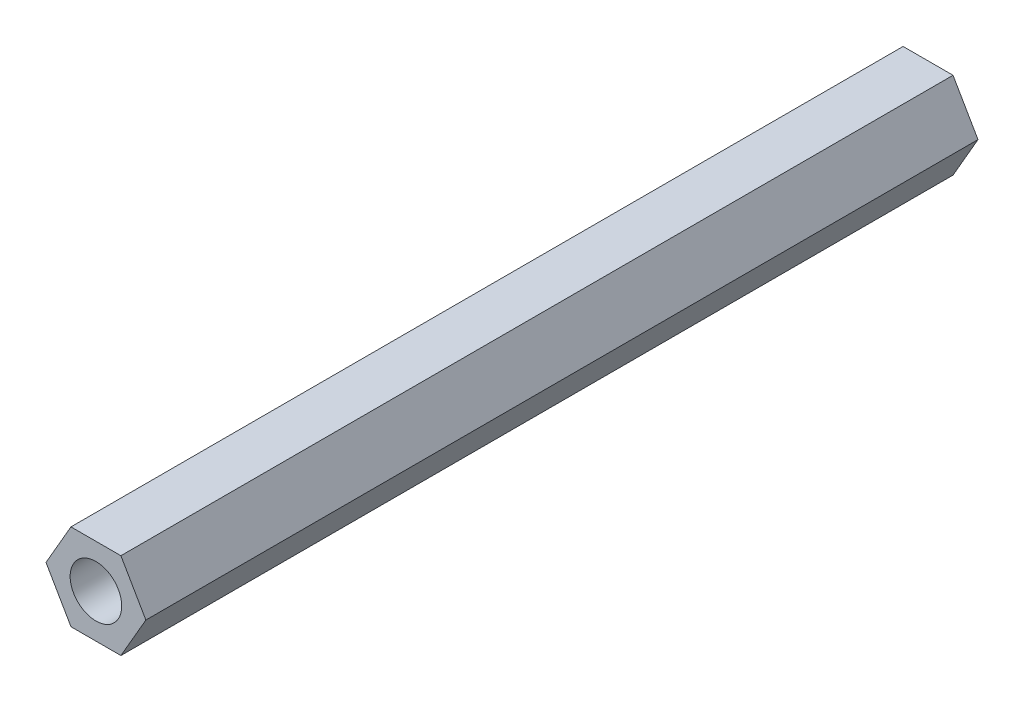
from build123d import *

# Parameters (mm, degrees)
SKETCH_1_R      = 1.55
EXTRUDE_1_DEPTH = 50


with BuildPart() as part:
    # Sketch 1 → Extrude 1 (new body)
    with BuildSketch(Plane.XY):
        Polygon((3, 0), (1.5, 2.598076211), (-1.5, 2.598076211), (-3, 0), (-1.5, -2.598076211), (1.5, -2.598076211), align=None)
        Circle(SKETCH_1_R, mode=Mode.SUBTRACT)
    extrude(amount=EXTRUDE_1_DEPTH)


solid = part.part
